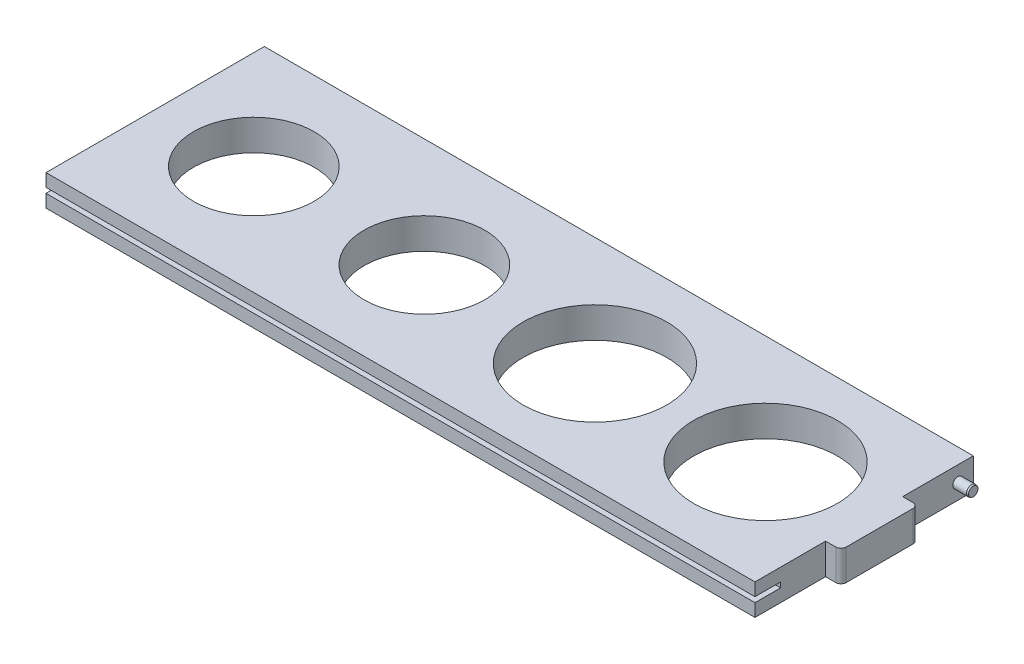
ISO-10303-21;
HEADER;
FILE_DESCRIPTION(('STEP AP214'),'2;1');
FILE_NAME('part.step','',(''),(''),'','','');
FILE_SCHEMA(('AUTOMOTIVE_DESIGN { 1 0 10303 214 1 1 1 1 }'));
ENDSEC;
DATA;
#1=APPLICATION_CONTEXT('core data for automotive mechanical design processes');
#2=APPLICATION_PROTOCOL_DEFINITION('international standard','automotive_design',2000,#1);
#3=PRODUCT_CONTEXT('',#1,'mechanical');
#4=PRODUCT('Part','Part','',(#3));
#5=PRODUCT_RELATED_PRODUCT_CATEGORY('part','',(#4));
#6=PRODUCT_DEFINITION_FORMATION('','',#4);
#7=PRODUCT_DEFINITION_CONTEXT('part definition',#1,'design');
#8=PRODUCT_DEFINITION('design','',#6,#7);
#9=PRODUCT_DEFINITION_SHAPE('','',#8);
#10=(LENGTH_UNIT() NAMED_UNIT(*) SI_UNIT(.MILLI.,.METRE.));
#11=(NAMED_UNIT(*) PLANE_ANGLE_UNIT() SI_UNIT($,.RADIAN.));
#12=(NAMED_UNIT(*) SI_UNIT($,.STERADIAN.) SOLID_ANGLE_UNIT());
#13=UNCERTAINTY_MEASURE_WITH_UNIT(LENGTH_MEASURE(1.E-05),#10,'distance_accuracy_value','');
#14=(GEOMETRIC_REPRESENTATION_CONTEXT(3) GLOBAL_UNCERTAINTY_ASSIGNED_CONTEXT((#13)) GLOBAL_UNIT_ASSIGNED_CONTEXT((#10,
#11,#12)) REPRESENTATION_CONTEXT('',''));
#15=CARTESIAN_POINT('',(0.,0.,0.));
#16=DIRECTION('',(0.,0.,1.));
#17=DIRECTION('',(1.,0.,0.));
#18=AXIS2_PLACEMENT_3D('',#15,#16,#17);
#19=CARTESIAN_POINT('',(34.,217.831192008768,-83.9999999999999));
#20=DIRECTION('',(1.,0.,0.));
#21=DIRECTION('',(0.,0.,-1.));
#22=AXIS2_PLACEMENT_3D('',#19,#20,#21);
#23=PLANE('',#22);
#24=CARTESIAN_POINT('',(34.,216.,-83.9999999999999));
#25=DIRECTION('',(-1.,0.,0.));
#26=DIRECTION('',(0.,0.,1.));
#27=AXIS2_PLACEMENT_3D('',#24,#25,#26);
#28=CIRCLE('',#27,1.8311920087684);
#29=CARTESIAN_POINT('',(34.,216.,-82.1688079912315));
#30=VERTEX_POINT('',#29);
#31=EDGE_CURVE('E60',#30,#30,#28,.T.);
#32=ORIENTED_EDGE('',*,*,#31,.T.);
#33=EDGE_LOOP('',(#32));
#34=FACE_BOUND('',#33,.T.);
#35=ADVANCED_FACE('F46',(#34),#23,.F.);
#36=CARTESIAN_POINT('',(54.,216.,-83.9999999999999));
#37=DIRECTION('',(-1.,0.,0.));
#38=DIRECTION('',(0.,0.,1.));
#39=AXIS2_PLACEMENT_3D('',#36,#37,#38);
#40=PLANE('',#39);
#41=CARTESIAN_POINT('',(54.,216.,-83.9999999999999));
#42=DIRECTION('',(-1.,0.,0.));
#43=DIRECTION('',(0.,0.,1.));
#44=AXIS2_PLACEMENT_3D('',#41,#42,#43);
#45=CIRCLE('',#44,1.8311920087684);
#46=CARTESIAN_POINT('',(54.,216.,-82.1688079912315));
#47=VERTEX_POINT('',#46);
#48=EDGE_CURVE('E11',#47,#47,#45,.T.);
#49=ORIENTED_EDGE('',*,*,#48,.F.);
#50=EDGE_LOOP('',(#49));
#51=FACE_BOUND('',#50,.T.);
#52=ADVANCED_FACE('F80',(#51),#40,.F.);
#53=CARTESIAN_POINT('',(54.,216.,-83.9999999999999));
#54=DIRECTION('',(-1.,0.,0.));
#55=DIRECTION('',(0.,0.,1.));
#56=AXIS2_PLACEMENT_3D('',#53,#54,#55);
#57=CONICAL_SURFACE('',#56,1.8311920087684,0.261799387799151);
#58=CARTESIAN_POINT('',(53.37,216.,-83.9999999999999));
#59=DIRECTION('',(-1.,0.,0.));
#60=DIRECTION('',(0.,0.,1.));
#61=AXIS2_PLACEMENT_3D('',#58,#59,#60);
#62=CIRCLE('',#61,2.);
#63=CARTESIAN_POINT('',(53.37,216.,-81.9999999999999));
#64=VERTEX_POINT('',#63);
#65=EDGE_CURVE('E52',#64,#64,#62,.T.);
#66=ORIENTED_EDGE('',*,*,#65,.F.);
#67=EDGE_LOOP('',(#66));
#68=FACE_BOUND('',#67,.T.);
#69=ORIENTED_EDGE('',*,*,#48,.T.);
#70=EDGE_LOOP('',(#69));
#71=FACE_BOUND('',#70,.T.);
#72=ADVANCED_FACE('F75',(#68,#71),#57,.T.);
#73=CARTESIAN_POINT('',(27.65,216.,-83.9999999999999));
#74=DIRECTION('',(-1.,0.,0.));
#75=DIRECTION('',(0.,0.,1.));
#76=AXIS2_PLACEMENT_3D('',#73,#74,#75);
#77=CYLINDRICAL_SURFACE('',#76,2.);
#78=CARTESIAN_POINT('',(34.63,216.,-83.9999999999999));
#79=DIRECTION('',(-1.,0.,0.));
#80=DIRECTION('',(0.,0.,1.));
#81=AXIS2_PLACEMENT_3D('',#78,#79,#80);
#82=CIRCLE('',#81,2.);
#83=CARTESIAN_POINT('',(34.63,216.,-81.9999999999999));
#84=VERTEX_POINT('',#83);
#85=EDGE_CURVE('E56',#84,#84,#82,.T.);
#86=ORIENTED_EDGE('',*,*,#85,.F.);
#87=EDGE_LOOP('',(#86));
#88=FACE_BOUND('',#87,.T.);
#89=ORIENTED_EDGE('',*,*,#65,.T.);
#90=EDGE_LOOP('',(#89));
#91=FACE_BOUND('',#90,.T.);
#92=ADVANCED_FACE('F70',(#88,#91),#77,.T.);
#93=CARTESIAN_POINT('',(34.63,216.,-83.9999999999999));
#94=DIRECTION('',(1.,0.,0.));
#95=DIRECTION('',(0.,0.,-1.));
#96=AXIS2_PLACEMENT_3D('',#93,#94,#95);
#97=CONICAL_SURFACE('',#96,2.,0.261799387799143);
#98=ORIENTED_EDGE('',*,*,#31,.F.);
#99=EDGE_LOOP('',(#98));
#100=FACE_BOUND('',#99,.T.);
#101=ORIENTED_EDGE('',*,*,#85,.T.);
#102=EDGE_LOOP('',(#101));
#103=FACE_BOUND('',#102,.T.);
#104=ADVANCED_FACE('F67',(#100,#103),#97,.T.);
#105=CLOSED_SHELL('',(#35,#52,#72,#92,#104));
#106=MANIFOLD_SOLID_BREP('B2',#105);
#107=CARTESIAN_POINT('',(48.,265.,-90.));
#108=DIRECTION('',(1.,0.,0.));
#109=DIRECTION('',(0.,0.,-1.));
#110=AXIS2_PLACEMENT_3D('',#107,#108,#109);
#111=PLANE('',#110);
#112=DIRECTION('',(0.,-1.,0.));
#113=VECTOR('',#112,1.);
#114=CARTESIAN_POINT('',(48.,222.,-32.5));
#115=LINE('',#114,#113);
#116=CARTESIAN_POINT('',(48.,222.,-32.5));
#117=VERTEX_POINT('',#116);
#118=CARTESIAN_POINT('',(48.,210.,-32.5));
#119=VERTEX_POINT('',#118);
#120=EDGE_CURVE('E233',#117,#119,#115,.T.);
#121=ORIENTED_EDGE('',*,*,#120,.F.);
#122=DIRECTION('',(0.,0.,1.));
#123=VECTOR('',#122,1.);
#124=CARTESIAN_POINT('',(48.,222.,-5.00000000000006));
#125=LINE('',#124,#123);
#126=CARTESIAN_POINT('',(48.,222.,-5.00000000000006));
#127=VERTEX_POINT('',#126);
#128=EDGE_CURVE('E327',#117,#127,#125,.T.);
#129=ORIENTED_EDGE('',*,*,#128,.T.);
#130=DIRECTION('',(0.,-1.,0.));
#131=VECTOR('',#130,1.);
#132=CARTESIAN_POINT('',(48.,222.,-5.00000000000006));
#133=LINE('',#132,#131);
#134=CARTESIAN_POINT('',(47.9999999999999,217.,-5.00000000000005));
#135=VERTEX_POINT('',#134);
#136=EDGE_CURVE('E335',#127,#135,#133,.T.);
#137=ORIENTED_EDGE('',*,*,#136,.T.);
#138=DIRECTION('',(0.,0.,-1.));
#139=VECTOR('',#138,1.);
#140=CARTESIAN_POINT('',(48.,217.,-90.));
#141=LINE('',#140,#139);
#142=CARTESIAN_POINT('',(47.9999999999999,217.,-15.));
#143=VERTEX_POINT('',#142);
#144=EDGE_CURVE('E269',#135,#143,#141,.T.);
#145=ORIENTED_EDGE('',*,*,#144,.T.);
#146=DIRECTION('',(0.,1.,0.));
#147=VECTOR('',#146,1.);
#148=CARTESIAN_POINT('',(48.,265.,-15.));
#149=LINE('',#148,#147);
#150=CARTESIAN_POINT('',(47.9999999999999,215.,-15.));
#151=VERTEX_POINT('',#150);
#152=EDGE_CURVE('E272',#151,#143,#149,.T.);
#153=ORIENTED_EDGE('',*,*,#152,.F.);
#154=DIRECTION('',(0.,0.,-1.));
#155=VECTOR('',#154,1.);
#156=CARTESIAN_POINT('',(48.,215.,-90.));
#157=LINE('',#156,#155);
#158=CARTESIAN_POINT('',(47.9999999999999,215.,-5.00000000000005));
#159=VERTEX_POINT('',#158);
#160=EDGE_CURVE('E274',#159,#151,#157,.T.);
#161=ORIENTED_EDGE('',*,*,#160,.F.);
#162=CARTESIAN_POINT('',(48.,210.,-5.00000000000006));
#163=VERTEX_POINT('',#162);
#164=EDGE_CURVE('E317',#159,#163,#133,.T.);
#165=ORIENTED_EDGE('',*,*,#164,.T.);
#166=DIRECTION('',(0.,0.,-1.));
#167=VECTOR('',#166,1.);
#168=CARTESIAN_POINT('',(48.,210.,-5.00000000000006));
#169=LINE('',#168,#167);
#170=EDGE_CURVE('E331',#163,#119,#169,.T.);
#171=ORIENTED_EDGE('',*,*,#170,.T.);
#172=EDGE_LOOP('',(#121,#129,#137,#145,#153,#161,#165,#171));
#173=FACE_BOUND('',#172,.T.);
#174=ADVANCED_FACE('F117',(#173),#111,.T.);
#175=CARTESIAN_POINT('',(60.002,222.,-5.00000000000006));
#176=DIRECTION('',(0.,0.,-1.));
#177=DIRECTION('',(-1.,0.,0.));
#178=AXIS2_PLACEMENT_3D('',#175,#176,#177);
#179=PLANE('',#178);
#180=DIRECTION('',(1.,0.,0.));
#181=VECTOR('',#180,1.);
#182=CARTESIAN_POINT('',(-438.668064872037,217.,-5.00000000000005));
#183=LINE('',#182,#181);
#184=CARTESIAN_POINT('',(-228.,217.,-5.00000000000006));
#185=VERTEX_POINT('',#184);
#186=EDGE_CURVE('E258',#185,#135,#183,.T.);
#187=ORIENTED_EDGE('',*,*,#186,.T.);
#188=ORIENTED_EDGE('',*,*,#136,.F.);
#189=DIRECTION('',(-1.,0.,0.));
#190=VECTOR('',#189,1.);
#191=CARTESIAN_POINT('',(60.002,222.,-5.00000000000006));
#192=LINE('',#191,#190);
#193=CARTESIAN_POINT('',(-228.,222.,-5.00000000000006));
#194=VERTEX_POINT('',#193);
#195=EDGE_CURVE('E311',#127,#194,#192,.T.);
#196=ORIENTED_EDGE('',*,*,#195,.T.);
#197=DIRECTION('',(0.,-1.,0.));
#198=VECTOR('',#197,1.);
#199=CARTESIAN_POINT('',(-228.,222.,-5.00000000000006));
#200=LINE('',#199,#198);
#201=EDGE_CURVE('E305',#194,#185,#200,.T.);
#202=ORIENTED_EDGE('',*,*,#201,.T.);
#203=EDGE_LOOP('',(#187,#188,#196,#202));
#204=FACE_BOUND('',#203,.T.);
#205=ADVANCED_FACE('F389',(#204),#179,.F.);
#206=CARTESIAN_POINT('',(48.,216.,-83.9999999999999));
#207=DIRECTION('',(1.,0.,0.));
#208=DIRECTION('',(0.,0.,-1.));
#209=AXIS2_PLACEMENT_3D('',#206,#207,#208);
#210=CIRCLE('',#209,2.);
#211=CARTESIAN_POINT('',(48.,216.,-85.9999999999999));
#212=VERTEX_POINT('',#211);
#213=EDGE_CURVE('E235',#212,#212,#210,.T.);
#214=ORIENTED_EDGE('',*,*,#213,.F.);
#215=EDGE_LOOP('',(#214));
#216=FACE_BOUND('',#215,.T.);
#217=DIRECTION('',(0.,1.,0.));
#218=VECTOR('',#217,1.);
#219=CARTESIAN_POINT('',(48.,222.,-62.5));
#220=LINE('',#219,#218);
#221=CARTESIAN_POINT('',(48.,210.,-62.5));
#222=VERTEX_POINT('',#221);
#223=CARTESIAN_POINT('',(48.,222.,-62.5));
#224=VERTEX_POINT('',#223);
#225=EDGE_CURVE('E243',#222,#224,#220,.T.);
#226=ORIENTED_EDGE('',*,*,#225,.F.);
#227=CARTESIAN_POINT('',(48.,210.,-89.9999999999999));
#228=VERTEX_POINT('',#227);
#229=EDGE_CURVE('E334',#222,#228,#169,.T.);
#230=ORIENTED_EDGE('',*,*,#229,.T.);
#231=DIRECTION('',(0.,1.,0.));
#232=VECTOR('',#231,1.);
#233=CARTESIAN_POINT('',(48.,222.,-89.9999999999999));
#234=LINE('',#233,#232);
#235=CARTESIAN_POINT('',(48.,222.,-89.9999999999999));
#236=VERTEX_POINT('',#235);
#237=EDGE_CURVE('E328',#228,#236,#234,.T.);
#238=ORIENTED_EDGE('',*,*,#237,.T.);
#239=EDGE_CURVE('E323',#236,#224,#125,.T.);
#240=ORIENTED_EDGE('',*,*,#239,.T.);
#241=EDGE_LOOP('',(#226,#230,#238,#240));
#242=FACE_BOUND('',#241,.T.);
#243=ADVANCED_FACE('F372',(#216,#242),#111,.T.);
#244=CARTESIAN_POINT('',(60.002,210.,-5.00000000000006));
#245=DIRECTION('',(0.,1.,0.));
#246=DIRECTION('',(0.,0.,1.));
#247=AXIS2_PLACEMENT_3D('',#244,#245,#246);
#248=PLANE('',#247);
#249=CARTESIAN_POINT('',(-189.6,210.,-47.5));
#250=DIRECTION('',(0.,1.,0.));
#251=DIRECTION('',(0.,0.,1.));
#252=AXIS2_PLACEMENT_3D('',#249,#250,#251);
#253=CIRCLE('',#252,23.5);
#254=CARTESIAN_POINT('',(-189.6,210.,-24.));
#255=VERTEX_POINT('',#254);
#256=EDGE_CURVE('E277',#255,#255,#253,.T.);
#257=ORIENTED_EDGE('',*,*,#256,.T.);
#258=EDGE_LOOP('',(#257));
#259=FACE_BOUND('',#258,.T.);
#260=CARTESIAN_POINT('',(-56.8,210.,-47.5));
#261=DIRECTION('',(0.,1.,0.));
#262=DIRECTION('',(0.,0.,1.));
#263=AXIS2_PLACEMENT_3D('',#260,#261,#262);
#264=CIRCLE('',#263,28.);
#265=CARTESIAN_POINT('',(-56.8,210.,-19.5));
#266=VERTEX_POINT('',#265);
#267=EDGE_CURVE('E284',#266,#266,#264,.T.);
#268=ORIENTED_EDGE('',*,*,#267,.T.);
#269=EDGE_LOOP('',(#268));
#270=FACE_BOUND('',#269,.T.);
#271=CARTESIAN_POINT('',(9.60000000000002,210.,-47.5));
#272=DIRECTION('',(0.,1.,0.));
#273=DIRECTION('',(0.,0.,1.));
#274=AXIS2_PLACEMENT_3D('',#271,#272,#273);
#275=CIRCLE('',#274,28.);
#276=CARTESIAN_POINT('',(9.60000000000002,210.,-19.5));
#277=VERTEX_POINT('',#276);
#278=EDGE_CURVE('E290',#277,#277,#275,.T.);
#279=ORIENTED_EDGE('',*,*,#278,.T.);
#280=EDGE_LOOP('',(#279));
#281=FACE_BOUND('',#280,.T.);
#282=CARTESIAN_POINT('',(-123.2,210.,-47.5));
#283=DIRECTION('',(0.,1.,0.));
#284=DIRECTION('',(0.,0.,1.));
#285=AXIS2_PLACEMENT_3D('',#282,#283,#284);
#286=CIRCLE('',#285,23.5);
#287=CARTESIAN_POINT('',(-123.2,210.,-24.));
#288=VERTEX_POINT('',#287);
#289=EDGE_CURVE('E296',#288,#288,#286,.T.);
#290=ORIENTED_EDGE('',*,*,#289,.T.);
#291=EDGE_LOOP('',(#290));
#292=FACE_BOUND('',#291,.T.);
#293=DIRECTION('',(-1.,0.,0.));
#294=VECTOR('',#293,1.);
#295=CARTESIAN_POINT('',(54.,210.,-62.5));
#296=LINE('',#295,#294);
#297=CARTESIAN_POINT('',(52.,210.,-62.5));
#298=VERTEX_POINT('',#297);
#299=EDGE_CURVE('E254',#298,#222,#296,.T.);
#300=ORIENTED_EDGE('',*,*,#299,.F.);
#301=CARTESIAN_POINT('',(52.,210.,-60.5));
#302=DIRECTION('',(0.,1.,0.));
#303=DIRECTION('',(0.,0.,1.));
#304=AXIS2_PLACEMENT_3D('',#301,#302,#303);
#305=CIRCLE('',#304,2.);
#306=CARTESIAN_POINT('',(54.,210.,-60.5));
#307=VERTEX_POINT('',#306);
#308=EDGE_CURVE('E126',#298,#307,#305,.F.);
#309=ORIENTED_EDGE('',*,*,#308,.T.);
#310=DIRECTION('',(0.,0.,-1.));
#311=VECTOR('',#310,1.);
#312=CARTESIAN_POINT('',(54.,210.,-32.5));
#313=LINE('',#312,#311);
#314=CARTESIAN_POINT('',(54.,210.,-34.5));
#315=VERTEX_POINT('',#314);
#316=EDGE_CURVE('E239',#315,#307,#313,.T.);
#317=ORIENTED_EDGE('',*,*,#316,.F.);
#318=CARTESIAN_POINT('',(52.,210.,-34.5));
#319=DIRECTION('',(0.,1.,0.));
#320=DIRECTION('',(0.,0.,1.));
#321=AXIS2_PLACEMENT_3D('',#318,#319,#320);
#322=CIRCLE('',#321,2.);
#323=CARTESIAN_POINT('',(52.,210.,-32.5));
#324=VERTEX_POINT('',#323);
#325=EDGE_CURVE('E133',#315,#324,#322,.F.);
#326=ORIENTED_EDGE('',*,*,#325,.T.);
#327=DIRECTION('',(-1.,0.,0.));
#328=VECTOR('',#327,1.);
#329=CARTESIAN_POINT('',(54.,210.,-32.5));
#330=LINE('',#329,#328);
#331=EDGE_CURVE('E256',#324,#119,#330,.T.);
#332=ORIENTED_EDGE('',*,*,#331,.T.);
#333=ORIENTED_EDGE('',*,*,#170,.F.);
#334=DIRECTION('',(-1.,0.,0.));
#335=VECTOR('',#334,1.);
#336=CARTESIAN_POINT('',(60.002,210.,-5.00000000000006));
#337=LINE('',#336,#335);
#338=CARTESIAN_POINT('',(-228.,210.,-5.00000000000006));
#339=VERTEX_POINT('',#338);
#340=EDGE_CURVE('E314',#163,#339,#337,.T.);
#341=ORIENTED_EDGE('',*,*,#340,.T.);
#342=DIRECTION('',(0.,0.,-1.));
#343=VECTOR('',#342,1.);
#344=CARTESIAN_POINT('',(-228.,210.,-5.00000000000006));
#345=LINE('',#344,#343);
#346=CARTESIAN_POINT('',(-228.,210.,-89.9999999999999));
#347=VERTEX_POINT('',#346);
#348=EDGE_CURVE('E301',#339,#347,#345,.T.);
#349=ORIENTED_EDGE('',*,*,#348,.T.);
#350=DIRECTION('',(-1.,0.,0.));
#351=VECTOR('',#350,1.);
#352=CARTESIAN_POINT('',(60.002,210.,-89.9999999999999));
#353=LINE('',#352,#351);
#354=EDGE_CURVE('E318',#228,#347,#353,.T.);
#355=ORIENTED_EDGE('',*,*,#354,.F.);
#356=ORIENTED_EDGE('',*,*,#229,.F.);
#357=EDGE_LOOP('',(#300,#309,#317,#326,#332,#333,#341,#349,#355,#356));
#358=FACE_BOUND('',#357,.T.);
#359=ADVANCED_FACE('F358',(#259,#270,#281,#292,#358),#248,.F.);
#360=ORIENTED_EDGE('',*,*,#164,.F.);
#361=DIRECTION('',(1.,0.,0.));
#362=VECTOR('',#361,1.);
#363=CARTESIAN_POINT('',(-438.668064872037,215.,-5.00000000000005));
#364=LINE('',#363,#362);
#365=CARTESIAN_POINT('',(-228.,215.,-5.00000000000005));
#366=VERTEX_POINT('',#365);
#367=EDGE_CURVE('E261',#366,#159,#364,.T.);
#368=ORIENTED_EDGE('',*,*,#367,.F.);
#369=EDGE_CURVE('E280',#366,#339,#200,.T.);
#370=ORIENTED_EDGE('',*,*,#369,.T.);
#371=ORIENTED_EDGE('',*,*,#340,.F.);
#372=EDGE_LOOP('',(#360,#368,#370,#371));
#373=FACE_BOUND('',#372,.T.);
#374=ADVANCED_FACE('F406',(#373),#179,.F.);
#375=CARTESIAN_POINT('',(-228.,0.,0.));
#376=DIRECTION('',(1.,0.,0.));
#377=DIRECTION('',(0.,0.,-1.));
#378=AXIS2_PLACEMENT_3D('',#375,#376,#377);
#379=PLANE('',#378);
#380=CARTESIAN_POINT('',(-228.,216.,-83.9999999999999));
#381=DIRECTION('',(1.,0.,0.));
#382=DIRECTION('',(0.,0.,-1.));
#383=AXIS2_PLACEMENT_3D('',#380,#381,#382);
#384=CIRCLE('',#383,2.25);
#385=CARTESIAN_POINT('',(-228.,216.,-86.2499999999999));
#386=VERTEX_POINT('',#385);
#387=EDGE_CURVE('E121',#386,#386,#384,.T.);
#388=ORIENTED_EDGE('',*,*,#387,.T.);
#389=EDGE_LOOP('',(#388));
#390=FACE_BOUND('',#389,.T.);
#391=ORIENTED_EDGE('',*,*,#369,.F.);
#392=DIRECTION('',(0.,0.,-1.));
#393=VECTOR('',#392,1.);
#394=CARTESIAN_POINT('',(-228.,215.,0.));
#395=LINE('',#394,#393);
#396=CARTESIAN_POINT('',(-228.,215.,-15.));
#397=VERTEX_POINT('',#396);
#398=EDGE_CURVE('E342',#366,#397,#395,.T.);
#399=ORIENTED_EDGE('',*,*,#398,.T.);
#400=DIRECTION('',(0.,1.,0.));
#401=VECTOR('',#400,1.);
#402=CARTESIAN_POINT('',(-228.,0.,-15.));
#403=LINE('',#402,#401);
#404=CARTESIAN_POINT('',(-228.,217.,-15.));
#405=VERTEX_POINT('',#404);
#406=EDGE_CURVE('E339',#397,#405,#403,.T.);
#407=ORIENTED_EDGE('',*,*,#406,.T.);
#408=DIRECTION('',(0.,0.,-1.));
#409=VECTOR('',#408,1.);
#410=CARTESIAN_POINT('',(-228.,217.,0.));
#411=LINE('',#410,#409);
#412=EDGE_CURVE('E326',#185,#405,#411,.T.);
#413=ORIENTED_EDGE('',*,*,#412,.F.);
#414=ORIENTED_EDGE('',*,*,#201,.F.);
#415=DIRECTION('',(0.,0.,1.));
#416=VECTOR('',#415,1.);
#417=CARTESIAN_POINT('',(-228.,222.,-5.00000000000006));
#418=LINE('',#417,#416);
#419=CARTESIAN_POINT('',(-228.,222.,-89.9999999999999));
#420=VERTEX_POINT('',#419);
#421=EDGE_CURVE('E308',#420,#194,#418,.T.);
#422=ORIENTED_EDGE('',*,*,#421,.F.);
#423=DIRECTION('',(0.,1.,0.));
#424=VECTOR('',#423,1.);
#425=CARTESIAN_POINT('',(-228.,222.,-89.9999999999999));
#426=LINE('',#425,#424);
#427=EDGE_CURVE('E304',#347,#420,#426,.T.);
#428=ORIENTED_EDGE('',*,*,#427,.F.);
#429=ORIENTED_EDGE('',*,*,#348,.F.);
#430=EDGE_LOOP('',(#391,#399,#407,#413,#414,#422,#428,#429));
#431=FACE_BOUND('',#430,.T.);
#432=ADVANCED_FACE('F387',(#390,#431),#379,.F.);
#433=CARTESIAN_POINT('',(60.002,222.,-89.9999999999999));
#434=DIRECTION('',(0.,0.,1.));
#435=DIRECTION('',(1.,0.,0.));
#436=AXIS2_PLACEMENT_3D('',#433,#434,#435);
#437=PLANE('',#436);
#438=ORIENTED_EDGE('',*,*,#237,.F.);
#439=ORIENTED_EDGE('',*,*,#354,.T.);
#440=ORIENTED_EDGE('',*,*,#427,.T.);
#441=DIRECTION('',(-1.,0.,0.));
#442=VECTOR('',#441,1.);
#443=CARTESIAN_POINT('',(60.002,222.,-89.9999999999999));
#444=LINE('',#443,#442);
#445=EDGE_CURVE('E320',#236,#420,#444,.T.);
#446=ORIENTED_EDGE('',*,*,#445,.F.);
#447=EDGE_LOOP('',(#438,#439,#440,#446));
#448=FACE_BOUND('',#447,.T.);
#449=ADVANCED_FACE('F378',(#448),#437,.F.);
#450=CARTESIAN_POINT('',(60.002,222.,-5.00000000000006));
#451=DIRECTION('',(0.,-1.,0.));
#452=DIRECTION('',(0.,0.,-1.));
#453=AXIS2_PLACEMENT_3D('',#450,#451,#452);
#454=PLANE('',#453);
#455=CARTESIAN_POINT('',(-189.6,222.,-47.5));
#456=DIRECTION('',(0.,1.,0.));
#457=DIRECTION('',(0.,0.,1.));
#458=AXIS2_PLACEMENT_3D('',#455,#456,#457);
#459=CIRCLE('',#458,23.5);
#460=CARTESIAN_POINT('',(-189.6,222.,-24.));
#461=VERTEX_POINT('',#460);
#462=EDGE_CURVE('E281',#461,#461,#459,.T.);
#463=ORIENTED_EDGE('',*,*,#462,.F.);
#464=EDGE_LOOP('',(#463));
#465=FACE_BOUND('',#464,.T.);
#466=CARTESIAN_POINT('',(-56.8,222.,-47.5));
#467=DIRECTION('',(0.,1.,0.));
#468=DIRECTION('',(0.,0.,1.));
#469=AXIS2_PLACEMENT_3D('',#466,#467,#468);
#470=CIRCLE('',#469,28.);
#471=CARTESIAN_POINT('',(-56.8,222.,-19.5));
#472=VERTEX_POINT('',#471);
#473=EDGE_CURVE('E287',#472,#472,#470,.T.);
#474=ORIENTED_EDGE('',*,*,#473,.F.);
#475=EDGE_LOOP('',(#474));
#476=FACE_BOUND('',#475,.T.);
#477=CARTESIAN_POINT('',(9.60000000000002,222.,-47.5));
#478=DIRECTION('',(0.,1.,0.));
#479=DIRECTION('',(0.,0.,1.));
#480=AXIS2_PLACEMENT_3D('',#477,#478,#479);
#481=CIRCLE('',#480,28.);
#482=CARTESIAN_POINT('',(9.60000000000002,222.,-19.5));
#483=VERTEX_POINT('',#482);
#484=EDGE_CURVE('E293',#483,#483,#481,.T.);
#485=ORIENTED_EDGE('',*,*,#484,.F.);
#486=EDGE_LOOP('',(#485));
#487=FACE_BOUND('',#486,.T.);
#488=CARTESIAN_POINT('',(-123.2,222.,-47.5));
#489=DIRECTION('',(0.,1.,0.));
#490=DIRECTION('',(0.,0.,1.));
#491=AXIS2_PLACEMENT_3D('',#488,#489,#490);
#492=CIRCLE('',#491,23.5);
#493=CARTESIAN_POINT('',(-123.2,222.,-24.));
#494=VERTEX_POINT('',#493);
#495=EDGE_CURVE('E276',#494,#494,#492,.T.);
#496=ORIENTED_EDGE('',*,*,#495,.F.);
#497=EDGE_LOOP('',(#496));
#498=FACE_BOUND('',#497,.T.);
#499=DIRECTION('',(0.,0.,1.));
#500=VECTOR('',#499,1.);
#501=CARTESIAN_POINT('',(54.,222.,-32.5));
#502=LINE('',#501,#500);
#503=CARTESIAN_POINT('',(54.,222.,-60.5));
#504=VERTEX_POINT('',#503);
#505=CARTESIAN_POINT('',(54.,222.,-34.5));
#506=VERTEX_POINT('',#505);
#507=EDGE_CURVE('E242',#504,#506,#502,.T.);
#508=ORIENTED_EDGE('',*,*,#507,.F.);
#509=CARTESIAN_POINT('',(52.,222.,-60.5));
#510=DIRECTION('',(0.,-1.,0.));
#511=DIRECTION('',(0.,0.,-1.));
#512=AXIS2_PLACEMENT_3D('',#509,#510,#511);
#513=CIRCLE('',#512,2.);
#514=CARTESIAN_POINT('',(52.,222.,-62.5));
#515=VERTEX_POINT('',#514);
#516=EDGE_CURVE('E353',#504,#515,#513,.F.);
#517=ORIENTED_EDGE('',*,*,#516,.T.);
#518=DIRECTION('',(-1.,0.,0.));
#519=VECTOR('',#518,1.);
#520=CARTESIAN_POINT('',(54.,222.,-62.5));
#521=LINE('',#520,#519);
#522=EDGE_CURVE('E252',#515,#224,#521,.T.);
#523=ORIENTED_EDGE('',*,*,#522,.T.);
#524=ORIENTED_EDGE('',*,*,#239,.F.);
#525=ORIENTED_EDGE('',*,*,#445,.T.);
#526=ORIENTED_EDGE('',*,*,#421,.T.);
#527=ORIENTED_EDGE('',*,*,#195,.F.);
#528=ORIENTED_EDGE('',*,*,#128,.F.);
#529=DIRECTION('',(-1.,0.,0.));
#530=VECTOR('',#529,1.);
#531=CARTESIAN_POINT('',(54.,222.,-32.5));
#532=LINE('',#531,#530);
#533=CARTESIAN_POINT('',(52.,222.,-32.5));
#534=VERTEX_POINT('',#533);
#535=EDGE_CURVE('E246',#534,#117,#532,.T.);
#536=ORIENTED_EDGE('',*,*,#535,.F.);
#537=CARTESIAN_POINT('',(52.,222.,-34.5));
#538=DIRECTION('',(0.,-1.,0.));
#539=DIRECTION('',(0.,0.,-1.));
#540=AXIS2_PLACEMENT_3D('',#537,#538,#539);
#541=CIRCLE('',#540,2.);
#542=EDGE_CURVE('E351',#534,#506,#541,.F.);
#543=ORIENTED_EDGE('',*,*,#542,.T.);
#544=EDGE_LOOP('',(#508,#517,#523,#524,#525,#526,#527,#528,#536,#543));
#545=FACE_BOUND('',#544,.T.);
#546=ADVANCED_FACE('F368',(#465,#476,#487,#498,#545),#454,.F.);
#547=CARTESIAN_POINT('',(-123.2,210.,-47.5));
#548=DIRECTION('',(0.,1.,0.));
#549=DIRECTION('',(0.,0.,1.));
#550=AXIS2_PLACEMENT_3D('',#547,#548,#549);
#551=CYLINDRICAL_SURFACE('',#550,23.5);
#552=ORIENTED_EDGE('',*,*,#289,.F.);
#553=EDGE_LOOP('',(#552));
#554=FACE_BOUND('',#553,.T.);
#555=ORIENTED_EDGE('',*,*,#495,.T.);
#556=EDGE_LOOP('',(#555));
#557=FACE_BOUND('',#556,.T.);
#558=ADVANCED_FACE('F437',(#554,#557),#551,.F.);
#559=CARTESIAN_POINT('',(9.60000000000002,210.,-47.5));
#560=DIRECTION('',(0.,1.,0.));
#561=DIRECTION('',(0.,0.,1.));
#562=AXIS2_PLACEMENT_3D('',#559,#560,#561);
#563=CYLINDRICAL_SURFACE('',#562,28.);
#564=ORIENTED_EDGE('',*,*,#278,.F.);
#565=EDGE_LOOP('',(#564));
#566=FACE_BOUND('',#565,.T.);
#567=ORIENTED_EDGE('',*,*,#484,.T.);
#568=EDGE_LOOP('',(#567));
#569=FACE_BOUND('',#568,.T.);
#570=ADVANCED_FACE('F446',(#566,#569),#563,.F.);
#571=CARTESIAN_POINT('',(-56.8,210.,-47.5));
#572=DIRECTION('',(0.,1.,0.));
#573=DIRECTION('',(0.,0.,1.));
#574=AXIS2_PLACEMENT_3D('',#571,#572,#573);
#575=CYLINDRICAL_SURFACE('',#574,28.);
#576=ORIENTED_EDGE('',*,*,#267,.F.);
#577=EDGE_LOOP('',(#576));
#578=FACE_BOUND('',#577,.T.);
#579=ORIENTED_EDGE('',*,*,#473,.T.);
#580=EDGE_LOOP('',(#579));
#581=FACE_BOUND('',#580,.T.);
#582=ADVANCED_FACE('F479',(#578,#581),#575,.F.);
#583=CARTESIAN_POINT('',(-189.6,210.,-47.5));
#584=DIRECTION('',(0.,1.,0.));
#585=DIRECTION('',(0.,0.,1.));
#586=AXIS2_PLACEMENT_3D('',#583,#584,#585);
#587=CYLINDRICAL_SURFACE('',#586,23.5);
#588=ORIENTED_EDGE('',*,*,#256,.F.);
#589=EDGE_LOOP('',(#588));
#590=FACE_BOUND('',#589,.T.);
#591=ORIENTED_EDGE('',*,*,#462,.T.);
#592=EDGE_LOOP('',(#591));
#593=FACE_BOUND('',#592,.T.);
#594=ADVANCED_FACE('F475',(#590,#593),#587,.F.);
#595=CARTESIAN_POINT('',(-438.668064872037,215.,-5.00000000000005));
#596=DIRECTION('',(0.,-1.,0.));
#597=DIRECTION('',(0.,0.,-1.));
#598=AXIS2_PLACEMENT_3D('',#595,#596,#597);
#599=PLANE('',#598);
#600=ORIENTED_EDGE('',*,*,#160,.T.);
#601=DIRECTION('',(1.,0.,0.));
#602=VECTOR('',#601,1.);
#603=CARTESIAN_POINT('',(-438.668064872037,215.,-15.));
#604=LINE('',#603,#602);
#605=EDGE_CURVE('E263',#397,#151,#604,.T.);
#606=ORIENTED_EDGE('',*,*,#605,.F.);
#607=ORIENTED_EDGE('',*,*,#398,.F.);
#608=ORIENTED_EDGE('',*,*,#367,.T.);
#609=EDGE_LOOP('',(#600,#606,#607,#608));
#610=FACE_BOUND('',#609,.T.);
#611=ADVANCED_FACE('F409',(#610),#599,.F.);
#612=CARTESIAN_POINT('',(-438.668064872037,215.,-15.));
#613=DIRECTION('',(0.,0.,-1.));
#614=DIRECTION('',(-1.,0.,0.));
#615=AXIS2_PLACEMENT_3D('',#612,#613,#614);
#616=PLANE('',#615);
#617=ORIENTED_EDGE('',*,*,#152,.T.);
#618=DIRECTION('',(1.,0.,0.));
#619=VECTOR('',#618,1.);
#620=CARTESIAN_POINT('',(-438.668064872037,217.,-15.));
#621=LINE('',#620,#619);
#622=EDGE_CURVE('E266',#405,#143,#621,.T.);
#623=ORIENTED_EDGE('',*,*,#622,.F.);
#624=ORIENTED_EDGE('',*,*,#406,.F.);
#625=ORIENTED_EDGE('',*,*,#605,.T.);
#626=EDGE_LOOP('',(#617,#623,#624,#625));
#627=FACE_BOUND('',#626,.T.);
#628=ADVANCED_FACE('F411',(#627),#616,.F.);
#629=CARTESIAN_POINT('',(-438.668064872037,217.,-5.00000000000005));
#630=DIRECTION('',(0.,-1.,0.));
#631=DIRECTION('',(0.,0.,-1.));
#632=AXIS2_PLACEMENT_3D('',#629,#630,#631);
#633=PLANE('',#632);
#634=ORIENTED_EDGE('',*,*,#186,.F.);
#635=ORIENTED_EDGE('',*,*,#412,.T.);
#636=ORIENTED_EDGE('',*,*,#622,.T.);
#637=ORIENTED_EDGE('',*,*,#144,.F.);
#638=EDGE_LOOP('',(#634,#635,#636,#637));
#639=FACE_BOUND('',#638,.T.);
#640=ADVANCED_FACE('F414',(#639),#633,.T.);
#641=CARTESIAN_POINT('',(54.,222.,-32.5));
#642=DIRECTION('',(0.,0.,-1.));
#643=DIRECTION('',(-1.,0.,0.));
#644=AXIS2_PLACEMENT_3D('',#641,#642,#643);
#645=PLANE('',#644);
#646=ORIENTED_EDGE('',*,*,#331,.F.);
#647=DIRECTION('',(0.,-1.,0.));
#648=VECTOR('',#647,1.);
#649=CARTESIAN_POINT('',(52.,222.,-32.5));
#650=LINE('',#649,#648);
#651=EDGE_CURVE('E44',#324,#534,#650,.F.);
#652=ORIENTED_EDGE('',*,*,#651,.T.);
#653=ORIENTED_EDGE('',*,*,#535,.T.);
#654=ORIENTED_EDGE('',*,*,#120,.T.);
#655=EDGE_LOOP('',(#646,#652,#653,#654));
#656=FACE_BOUND('',#655,.T.);
#657=ADVANCED_FACE('F399',(#656),#645,.F.);
#658=CARTESIAN_POINT('',(54.,222.,-62.5));
#659=DIRECTION('',(0.,0.,1.));
#660=DIRECTION('',(0.,-1.,0.));
#661=AXIS2_PLACEMENT_3D('',#658,#659,#660);
#662=PLANE('',#661);
#663=ORIENTED_EDGE('',*,*,#522,.F.);
#664=DIRECTION('',(0.,1.,0.));
#665=VECTOR('',#664,1.);
#666=CARTESIAN_POINT('',(52.,210.,-62.5));
#667=LINE('',#666,#665);
#668=EDGE_CURVE('E141',#515,#298,#667,.F.);
#669=ORIENTED_EDGE('',*,*,#668,.T.);
#670=ORIENTED_EDGE('',*,*,#299,.T.);
#671=ORIENTED_EDGE('',*,*,#225,.T.);
#672=EDGE_LOOP('',(#663,#669,#670,#671));
#673=FACE_BOUND('',#672,.T.);
#674=ADVANCED_FACE('F369',(#673),#662,.F.);
#675=CARTESIAN_POINT('',(54.,0.,0.));
#676=DIRECTION('',(1.,0.,0.));
#677=DIRECTION('',(0.,0.,-1.));
#678=AXIS2_PLACEMENT_3D('',#675,#676,#677);
#679=PLANE('',#678);
#680=ORIENTED_EDGE('',*,*,#316,.T.);
#681=DIRECTION('',(0.,1.,0.));
#682=VECTOR('',#681,1.);
#683=CARTESIAN_POINT('',(54.,222.,-60.5));
#684=LINE('',#683,#682);
#685=EDGE_CURVE('E348',#307,#504,#684,.T.);
#686=ORIENTED_EDGE('',*,*,#685,.T.);
#687=ORIENTED_EDGE('',*,*,#507,.T.);
#688=DIRECTION('',(0.,-1.,0.));
#689=VECTOR('',#688,1.);
#690=CARTESIAN_POINT('',(54.,210.,-34.5));
#691=LINE('',#690,#689);
#692=EDGE_CURVE('E345',#506,#315,#691,.T.);
#693=ORIENTED_EDGE('',*,*,#692,.T.);
#694=EDGE_LOOP('',(#680,#686,#687,#693));
#695=FACE_BOUND('',#694,.T.);
#696=ADVANCED_FACE('F363',(#695),#679,.T.);
#697=CARTESIAN_POINT('',(52.,0.,-60.5000000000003));
#698=DIRECTION('',(0.,-1.,0.));
#699=DIRECTION('',(0.,0.,-1.));
#700=AXIS2_PLACEMENT_3D('',#697,#698,#699);
#701=CYLINDRICAL_SURFACE('',#700,2.);
#702=ORIENTED_EDGE('',*,*,#308,.F.);
#703=ORIENTED_EDGE('',*,*,#668,.F.);
#704=ORIENTED_EDGE('',*,*,#516,.F.);
#705=ORIENTED_EDGE('',*,*,#685,.F.);
#706=EDGE_LOOP('',(#702,#703,#704,#705));
#707=FACE_BOUND('',#706,.T.);
#708=ADVANCED_FACE('F366',(#707),#701,.T.);
#709=CARTESIAN_POINT('',(52.,0.,-34.5));
#710=DIRECTION('',(0.,1.,0.));
#711=DIRECTION('',(0.,0.,1.));
#712=AXIS2_PLACEMENT_3D('',#709,#710,#711);
#713=CYLINDRICAL_SURFACE('',#712,2.);
#714=ORIENTED_EDGE('',*,*,#542,.F.);
#715=ORIENTED_EDGE('',*,*,#651,.F.);
#716=ORIENTED_EDGE('',*,*,#325,.F.);
#717=ORIENTED_EDGE('',*,*,#692,.F.);
#718=EDGE_LOOP('',(#714,#715,#716,#717));
#719=FACE_BOUND('',#718,.T.);
#720=ADVANCED_FACE('F119',(#719),#713,.T.);
#721=CARTESIAN_POINT('',(-240.,216.,-83.9999999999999));
#722=DIRECTION('',(-1.,0.,0.));
#723=DIRECTION('',(0.,0.,1.));
#724=AXIS2_PLACEMENT_3D('',#721,#722,#723);
#725=CYLINDRICAL_SURFACE('',#724,2.25);
#726=CARTESIAN_POINT('',(-211.351936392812,216.,-83.9999999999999));
#727=DIRECTION('',(-1.,0.,0.));
#728=DIRECTION('',(0.,0.,1.));
#729=AXIS2_PLACEMENT_3D('',#726,#727,#728);
#730=CIRCLE('',#729,2.25);
#731=CARTESIAN_POINT('',(-211.351936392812,216.,-81.7499999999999));
#732=VERTEX_POINT('',#731);
#733=EDGE_CURVE('E228',#732,#732,#730,.T.);
#734=ORIENTED_EDGE('',*,*,#733,.F.);
#735=EDGE_LOOP('',(#734));
#736=FACE_BOUND('',#735,.T.);
#737=ORIENTED_EDGE('',*,*,#387,.F.);
#738=EDGE_LOOP('',(#737));
#739=FACE_BOUND('',#738,.T.);
#740=ADVANCED_FACE('F224',(#736,#739),#725,.F.);
#741=CARTESIAN_POINT('',(-211.351936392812,216.,-83.9999999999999));
#742=DIRECTION('',(-1.,0.,0.));
#743=DIRECTION('',(0.,0.,1.));
#744=AXIS2_PLACEMENT_3D('',#741,#742,#743);
#745=CONICAL_SURFACE('',#744,2.25,1.02974425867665);
#746=CARTESIAN_POINT('',(-210.,216.,-83.9999999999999));
#747=VERTEX_POINT('',#746);
#748=VERTEX_LOOP('',#747);
#749=FACE_BOUND('',#748,.T.);
#750=ORIENTED_EDGE('',*,*,#733,.T.);
#751=EDGE_LOOP('',(#750));
#752=FACE_BOUND('',#751,.T.);
#753=ADVANCED_FACE('F220',(#749,#752),#745,.F.);
#754=CARTESIAN_POINT('',(34.,216.,-83.9999999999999));
#755=DIRECTION('',(-1.,0.,0.));
#756=DIRECTION('',(0.,0.,1.));
#757=AXIS2_PLACEMENT_3D('',#754,#755,#756);
#758=PLANE('',#757);
#759=CARTESIAN_POINT('',(34.,216.,-83.9999999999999));
#760=DIRECTION('',(1.,0.,0.));
#761=DIRECTION('',(0.,0.,-1.));
#762=AXIS2_PLACEMENT_3D('',#759,#760,#761);
#763=CIRCLE('',#762,2.);
#764=CARTESIAN_POINT('',(34.,216.,-85.9999999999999));
#765=VERTEX_POINT('',#764);
#766=EDGE_CURVE('E230',#765,#765,#763,.T.);
#767=ORIENTED_EDGE('',*,*,#766,.T.);
#768=EDGE_LOOP('',(#767));
#769=FACE_BOUND('',#768,.T.);
#770=ADVANCED_FACE('F223',(#769),#758,.F.);
#771=CARTESIAN_POINT('',(48.,216.,-83.9999999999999));
#772=DIRECTION('',(1.,0.,0.));
#773=DIRECTION('',(0.,0.,-1.));
#774=AXIS2_PLACEMENT_3D('',#771,#772,#773);
#775=CYLINDRICAL_SURFACE('',#774,2.);
#776=ORIENTED_EDGE('',*,*,#766,.F.);
#777=EDGE_LOOP('',(#776));
#778=FACE_BOUND('',#777,.T.);
#779=ORIENTED_EDGE('',*,*,#213,.T.);
#780=EDGE_LOOP('',(#779));
#781=FACE_BOUND('',#780,.T.);
#782=ADVANCED_FACE('F583',(#778,#781),#775,.F.);
#783=CLOSED_SHELL('',(#174,#205,#243,#359,#374,#432,#449,#546,#558,#570,#582,#594,#611,#628,
#640,#657,#674,#696,#708,#720,#740,#753,#770,#782));
#784=MANIFOLD_SOLID_BREP('B6',#783);
#785=ADVANCED_BREP_SHAPE_REPRESENTATION('',(#18,#106,#784),#14);
#786=SHAPE_DEFINITION_REPRESENTATION(#9,#785);
ENDSEC;
END-ISO-10303-21;
